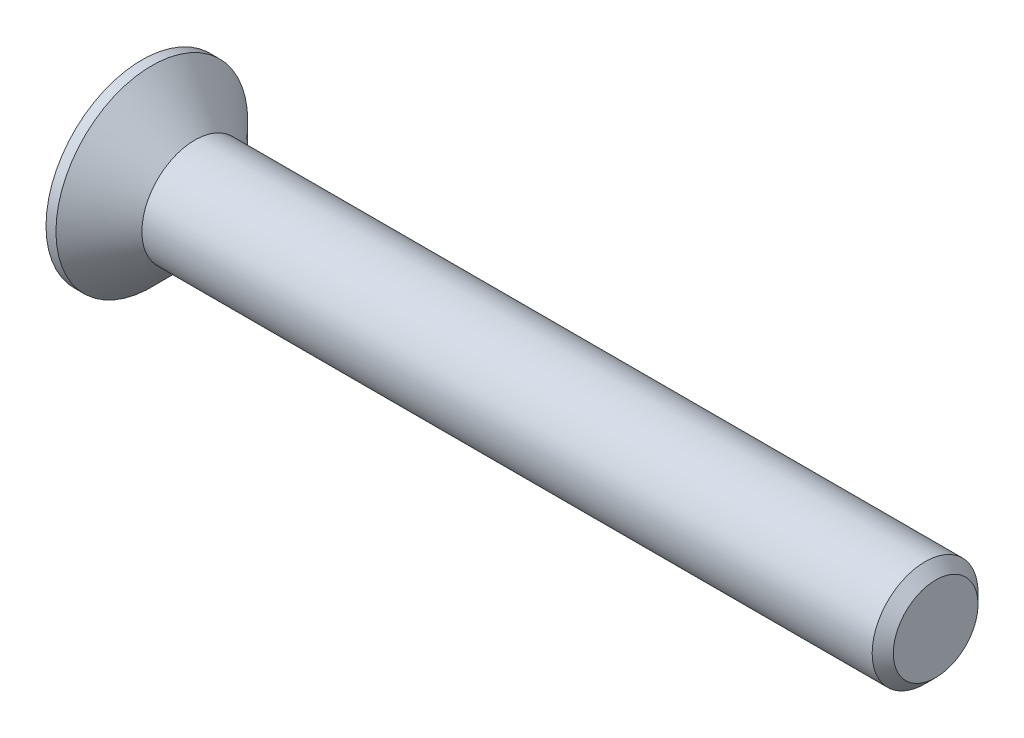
ISO-10303-21;
HEADER;
FILE_DESCRIPTION(('STEP AP214'),'2;1');
FILE_NAME('part.step','',(''),(''),'','','');
FILE_SCHEMA(('AUTOMOTIVE_DESIGN { 1 0 10303 214 1 1 1 1 }'));
ENDSEC;
DATA;
#1=APPLICATION_CONTEXT('core data for automotive mechanical design processes');
#2=APPLICATION_PROTOCOL_DEFINITION('international standard','automotive_design',2000,#1);
#3=PRODUCT_CONTEXT('',#1,'mechanical');
#4=PRODUCT('Part','Part','',(#3));
#5=PRODUCT_RELATED_PRODUCT_CATEGORY('part','',(#4));
#6=PRODUCT_DEFINITION_FORMATION('','',#4);
#7=PRODUCT_DEFINITION_CONTEXT('part definition',#1,'design');
#8=PRODUCT_DEFINITION('design','',#6,#7);
#9=PRODUCT_DEFINITION_SHAPE('','',#8);
#10=(LENGTH_UNIT() NAMED_UNIT(*) SI_UNIT(.MILLI.,.METRE.));
#11=(NAMED_UNIT(*) PLANE_ANGLE_UNIT() SI_UNIT($,.RADIAN.));
#12=(NAMED_UNIT(*) SI_UNIT($,.STERADIAN.) SOLID_ANGLE_UNIT());
#13=UNCERTAINTY_MEASURE_WITH_UNIT(LENGTH_MEASURE(1.E-05),#10,'distance_accuracy_value','');
#14=(GEOMETRIC_REPRESENTATION_CONTEXT(3) GLOBAL_UNCERTAINTY_ASSIGNED_CONTEXT((#13)) GLOBAL_UNIT_ASSIGNED_CONTEXT((#10,
#11,#12)) REPRESENTATION_CONTEXT('',''));
#15=CARTESIAN_POINT('',(0.,0.,0.));
#16=DIRECTION('',(0.,0.,1.));
#17=DIRECTION('',(1.,0.,0.));
#18=AXIS2_PLACEMENT_3D('',#15,#16,#17);
#19=CARTESIAN_POINT('',(0.,0.,0.));
#20=DIRECTION('',(-1.,0.,0.));
#21=DIRECTION('',(0.,0.,1.));
#22=AXIS2_PLACEMENT_3D('',#19,#20,#21);
#23=CONICAL_SURFACE('',#22,4.,0.78539816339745);
#24=CARTESIAN_POINT('',(-3.24999999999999,0.,0.));
#25=DIRECTION('',(-1.,0.,0.));
#26=DIRECTION('',(0.,0.,1.));
#27=AXIS2_PLACEMENT_3D('',#24,#25,#26);
#28=CIRCLE('',#27,7.25);
#29=CARTESIAN_POINT('',(-3.24999999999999,0.,7.25));
#30=VERTEX_POINT('',#29);
#31=EDGE_CURVE('E189',#30,#30,#28,.T.);
#32=ORIENTED_EDGE('',*,*,#31,.F.);
#33=EDGE_LOOP('',(#32));
#34=FACE_BOUND('',#33,.T.);
#35=CARTESIAN_POINT('',(0.,0.,0.));
#36=DIRECTION('',(-1.,0.,0.));
#37=DIRECTION('',(0.,0.,1.));
#38=AXIS2_PLACEMENT_3D('',#35,#36,#37);
#39=CIRCLE('',#38,4.);
#40=CARTESIAN_POINT('',(0.,0.,4.));
#41=VERTEX_POINT('',#40);
#42=EDGE_CURVE('E212',#41,#41,#39,.T.);
#43=ORIENTED_EDGE('',*,*,#42,.T.);
#44=EDGE_LOOP('',(#43));
#45=FACE_BOUND('',#44,.T.);
#46=ADVANCED_FACE('F33',(#34,#45),#23,.T.);
#47=CARTESIAN_POINT('',(-4.,0.,0.));
#48=DIRECTION('',(-1.,0.,0.));
#49=DIRECTION('',(0.,0.,1.));
#50=AXIS2_PLACEMENT_3D('',#47,#48,#49);
#51=CYLINDRICAL_SURFACE('',#50,4.);
#52=CARTESIAN_POINT('',(55.2,0.,0.));
#53=DIRECTION('',(-1.,0.,0.));
#54=DIRECTION('',(0.,0.,1.));
#55=AXIS2_PLACEMENT_3D('',#52,#53,#54);
#56=CIRCLE('',#55,4.);
#57=CARTESIAN_POINT('',(55.2,0.,4.));
#58=VERTEX_POINT('',#57);
#59=EDGE_CURVE('E41',#58,#58,#56,.T.);
#60=ORIENTED_EDGE('',*,*,#59,.T.);
#61=EDGE_LOOP('',(#60));
#62=FACE_BOUND('',#61,.T.);
#63=ORIENTED_EDGE('',*,*,#42,.F.);
#64=EDGE_LOOP('',(#63));
#65=FACE_BOUND('',#64,.T.);
#66=ADVANCED_FACE('F217',(#62,#65),#51,.T.);
#67=CARTESIAN_POINT('',(56.,0.,0.));
#68=DIRECTION('',(-1.,0.,0.));
#69=DIRECTION('',(0.,0.,1.));
#70=AXIS2_PLACEMENT_3D('',#67,#68,#69);
#71=PLANE('',#70);
#72=CARTESIAN_POINT('',(56.,0.,0.));
#73=DIRECTION('',(-1.,0.,0.));
#74=DIRECTION('',(0.,0.,1.));
#75=AXIS2_PLACEMENT_3D('',#72,#73,#74);
#76=CIRCLE('',#75,3.20000000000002);
#77=CARTESIAN_POINT('',(56.,0.,3.20000000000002));
#78=VERTEX_POINT('',#77);
#79=EDGE_CURVE('E11',#78,#78,#76,.F.);
#80=ORIENTED_EDGE('',*,*,#79,.T.);
#81=EDGE_LOOP('',(#80));
#82=FACE_BOUND('',#81,.T.);
#83=ADVANCED_FACE('F239',(#82),#71,.F.);
#84=CARTESIAN_POINT('',(-4.,7.25,0.));
#85=DIRECTION('',(1.,0.,0.));
#86=DIRECTION('',(0.,0.,-1.));
#87=AXIS2_PLACEMENT_3D('',#84,#85,#86);
#88=PLANE('',#87);
#89=DIRECTION('',(0.,0.,-1.));
#90=VECTOR('',#89,1.);
#91=CARTESIAN_POINT('',(-4.,1.09,-4.35));
#92=LINE('',#91,#90);
#93=CARTESIAN_POINT('',(-4.,1.09,-1.09));
#94=VERTEX_POINT('',#93);
#95=CARTESIAN_POINT('',(-4.,1.09,-4.35));
#96=VERTEX_POINT('',#95);
#97=EDGE_CURVE('E158',#94,#96,#92,.T.);
#98=ORIENTED_EDGE('',*,*,#97,.F.);
#99=DIRECTION('',(0.,-1.,0.));
#100=VECTOR('',#99,1.);
#101=CARTESIAN_POINT('',(-4.,1.09,-1.09));
#102=LINE('',#101,#100);
#103=CARTESIAN_POINT('',(-4.,4.35,-1.09));
#104=VERTEX_POINT('',#103);
#105=EDGE_CURVE('E48',#104,#94,#102,.T.);
#106=ORIENTED_EDGE('',*,*,#105,.F.);
#107=DIRECTION('',(0.,0.,-1.));
#108=VECTOR('',#107,1.);
#109=CARTESIAN_POINT('',(-4.,4.35,-1.09));
#110=LINE('',#109,#108);
#111=CARTESIAN_POINT('',(-4.,4.35,1.09));
#112=VERTEX_POINT('',#111);
#113=EDGE_CURVE('E185',#112,#104,#110,.T.);
#114=ORIENTED_EDGE('',*,*,#113,.F.);
#115=DIRECTION('',(0.,1.,0.));
#116=VECTOR('',#115,1.);
#117=CARTESIAN_POINT('',(-4.,4.35,1.09));
#118=LINE('',#117,#116);
#119=CARTESIAN_POINT('',(-4.,1.09,1.09));
#120=VERTEX_POINT('',#119);
#121=EDGE_CURVE('E183',#120,#112,#118,.T.);
#122=ORIENTED_EDGE('',*,*,#121,.F.);
#123=DIRECTION('',(0.,0.,-1.));
#124=VECTOR('',#123,1.);
#125=CARTESIAN_POINT('',(-4.,1.09,1.09));
#126=LINE('',#125,#124);
#127=CARTESIAN_POINT('',(-4.,1.09,4.35));
#128=VERTEX_POINT('',#127);
#129=EDGE_CURVE('E132',#128,#120,#126,.T.);
#130=ORIENTED_EDGE('',*,*,#129,.F.);
#131=DIRECTION('',(0.,1.,0.));
#132=VECTOR('',#131,1.);
#133=CARTESIAN_POINT('',(-4.,1.09,4.35));
#134=LINE('',#133,#132);
#135=CARTESIAN_POINT('',(-4.,-1.09,4.35));
#136=VERTEX_POINT('',#135);
#137=EDGE_CURVE('E179',#136,#128,#134,.T.);
#138=ORIENTED_EDGE('',*,*,#137,.F.);
#139=DIRECTION('',(0.,0.,1.));
#140=VECTOR('',#139,1.);
#141=CARTESIAN_POINT('',(-4.,-1.09,4.35));
#142=LINE('',#141,#140);
#143=CARTESIAN_POINT('',(-4.,-1.09,1.09));
#144=VERTEX_POINT('',#143);
#145=EDGE_CURVE('E176',#144,#136,#142,.T.);
#146=ORIENTED_EDGE('',*,*,#145,.F.);
#147=DIRECTION('',(0.,1.,0.));
#148=VECTOR('',#147,1.);
#149=CARTESIAN_POINT('',(-4.,-1.09,1.09));
#150=LINE('',#149,#148);
#151=CARTESIAN_POINT('',(-4.,-4.35,1.09));
#152=VERTEX_POINT('',#151);
#153=EDGE_CURVE('E173',#152,#144,#150,.T.);
#154=ORIENTED_EDGE('',*,*,#153,.F.);
#155=DIRECTION('',(0.,0.,1.));
#156=VECTOR('',#155,1.);
#157=CARTESIAN_POINT('',(-4.,-4.35,1.09));
#158=LINE('',#157,#156);
#159=CARTESIAN_POINT('',(-4.,-4.35,-1.09));
#160=VERTEX_POINT('',#159);
#161=EDGE_CURVE('E170',#160,#152,#158,.T.);
#162=ORIENTED_EDGE('',*,*,#161,.F.);
#163=DIRECTION('',(0.,-1.,0.));
#164=VECTOR('',#163,1.);
#165=CARTESIAN_POINT('',(-4.,-4.35,-1.09));
#166=LINE('',#165,#164);
#167=CARTESIAN_POINT('',(-4.,-1.09,-1.09));
#168=VERTEX_POINT('',#167);
#169=EDGE_CURVE('E167',#168,#160,#166,.T.);
#170=ORIENTED_EDGE('',*,*,#169,.F.);
#171=DIRECTION('',(0.,0.,1.));
#172=VECTOR('',#171,1.);
#173=CARTESIAN_POINT('',(-4.,-1.09,-1.09));
#174=LINE('',#173,#172);
#175=CARTESIAN_POINT('',(-4.,-1.09,-4.35));
#176=VERTEX_POINT('',#175);
#177=EDGE_CURVE('E164',#176,#168,#174,.T.);
#178=ORIENTED_EDGE('',*,*,#177,.F.);
#179=DIRECTION('',(0.,-1.,0.));
#180=VECTOR('',#179,1.);
#181=CARTESIAN_POINT('',(-4.,-1.09,-4.35));
#182=LINE('',#181,#180);
#183=EDGE_CURVE('E161',#96,#176,#182,.T.);
#184=ORIENTED_EDGE('',*,*,#183,.F.);
#185=EDGE_LOOP('',(#98,#106,#114,#122,#130,#138,#146,#154,#162,#170,#178,#184));
#186=FACE_BOUND('',#185,.T.);
#187=CARTESIAN_POINT('',(-4.,0.,0.));
#188=DIRECTION('',(-1.,0.,0.));
#189=DIRECTION('',(0.,0.,1.));
#190=AXIS2_PLACEMENT_3D('',#187,#188,#189);
#191=CIRCLE('',#190,7.25);
#192=CARTESIAN_POINT('',(-4.,0.,7.25));
#193=VERTEX_POINT('',#192);
#194=EDGE_CURVE('E209',#193,#193,#191,.T.);
#195=ORIENTED_EDGE('',*,*,#194,.T.);
#196=EDGE_LOOP('',(#195));
#197=FACE_BOUND('',#196,.T.);
#198=ADVANCED_FACE('F230',(#186,#197),#88,.F.);
#199=CARTESIAN_POINT('',(-4.,0.,0.));
#200=DIRECTION('',(-1.,0.,0.));
#201=DIRECTION('',(0.,0.,1.));
#202=AXIS2_PLACEMENT_3D('',#199,#200,#201);
#203=CYLINDRICAL_SURFACE('',#202,7.25);
#204=ORIENTED_EDGE('',*,*,#194,.F.);
#205=EDGE_LOOP('',(#204));
#206=FACE_BOUND('',#205,.T.);
#207=ORIENTED_EDGE('',*,*,#31,.T.);
#208=EDGE_LOOP('',(#207));
#209=FACE_BOUND('',#208,.T.);
#210=ADVANCED_FACE('F222',(#206,#209),#203,.T.);
#211=CARTESIAN_POINT('',(55.2,0.,0.));
#212=DIRECTION('',(-1.,0.,0.));
#213=DIRECTION('',(0.,0.,1.));
#214=AXIS2_PLACEMENT_3D('',#211,#212,#213);
#215=CONICAL_SURFACE('',#214,4.,0.785398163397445);
#216=ORIENTED_EDGE('',*,*,#79,.F.);
#217=EDGE_LOOP('',(#216));
#218=FACE_BOUND('',#217,.T.);
#219=ORIENTED_EDGE('',*,*,#59,.F.);
#220=EDGE_LOOP('',(#219));
#221=FACE_BOUND('',#220,.T.);
#222=ADVANCED_FACE('F35',(#218,#221),#215,.T.);
#223=CARTESIAN_POINT('',(-0.55,1.09,-1.09));
#224=DIRECTION('',(0.,0.,-1.));
#225=DIRECTION('',(-1.,0.,0.));
#226=AXIS2_PLACEMENT_3D('',#223,#224,#225);
#227=PLANE('',#226);
#228=ORIENTED_EDGE('',*,*,#105,.T.);
#229=DIRECTION('',(-1.,0.,0.));
#230=VECTOR('',#229,1.);
#231=CARTESIAN_POINT('',(-0.55,1.09,-1.09));
#232=LINE('',#231,#230);
#233=CARTESIAN_POINT('',(-0.55,1.09,-1.09));
#234=VERTEX_POINT('',#233);
#235=EDGE_CURVE('E96',#234,#94,#232,.T.);
#236=ORIENTED_EDGE('',*,*,#235,.F.);
#237=DIRECTION('',(0.,-1.,0.));
#238=VECTOR('',#237,1.);
#239=CARTESIAN_POINT('',(-0.55,1.09,-1.09));
#240=LINE('',#239,#238);
#241=CARTESIAN_POINT('',(-0.55,4.35,-1.09));
#242=VERTEX_POINT('',#241);
#243=EDGE_CURVE('E187',#242,#234,#240,.T.);
#244=ORIENTED_EDGE('',*,*,#243,.F.);
#245=DIRECTION('',(-1.,0.,0.));
#246=VECTOR('',#245,1.);
#247=CARTESIAN_POINT('',(-0.55,4.35,-1.09));
#248=LINE('',#247,#246);
#249=EDGE_CURVE('E56',#242,#104,#248,.T.);
#250=ORIENTED_EDGE('',*,*,#249,.T.);
#251=EDGE_LOOP('',(#228,#236,#244,#250));
#252=FACE_BOUND('',#251,.T.);
#253=ADVANCED_FACE('F221',(#252),#227,.F.);
#254=CARTESIAN_POINT('',(-0.55,4.35,-1.09));
#255=DIRECTION('',(0.,1.,0.));
#256=DIRECTION('',(-1.,0.,0.));
#257=AXIS2_PLACEMENT_3D('',#254,#255,#256);
#258=PLANE('',#257);
#259=ORIENTED_EDGE('',*,*,#113,.T.);
#260=ORIENTED_EDGE('',*,*,#249,.F.);
#261=DIRECTION('',(0.,0.,-1.));
#262=VECTOR('',#261,1.);
#263=CARTESIAN_POINT('',(-0.55,4.35,-1.09));
#264=LINE('',#263,#262);
#265=CARTESIAN_POINT('',(-0.55,4.35,1.09));
#266=VERTEX_POINT('',#265);
#267=EDGE_CURVE('E144',#266,#242,#264,.T.);
#268=ORIENTED_EDGE('',*,*,#267,.F.);
#269=DIRECTION('',(-1.,0.,0.));
#270=VECTOR('',#269,1.);
#271=CARTESIAN_POINT('',(-0.55,4.35,1.09));
#272=LINE('',#271,#270);
#273=EDGE_CURVE('E136',#266,#112,#272,.T.);
#274=ORIENTED_EDGE('',*,*,#273,.T.);
#275=EDGE_LOOP('',(#259,#260,#268,#274));
#276=FACE_BOUND('',#275,.T.);
#277=ADVANCED_FACE('F228',(#276),#258,.F.);
#278=CARTESIAN_POINT('',(-0.55,4.35,1.09));
#279=DIRECTION('',(0.,0.,1.));
#280=DIRECTION('',(1.,0.,0.));
#281=AXIS2_PLACEMENT_3D('',#278,#279,#280);
#282=PLANE('',#281);
#283=ORIENTED_EDGE('',*,*,#121,.T.);
#284=ORIENTED_EDGE('',*,*,#273,.F.);
#285=DIRECTION('',(0.,1.,0.));
#286=VECTOR('',#285,1.);
#287=CARTESIAN_POINT('',(-0.55,4.35,1.09));
#288=LINE('',#287,#286);
#289=CARTESIAN_POINT('',(-0.55,1.09,1.09));
#290=VERTEX_POINT('',#289);
#291=EDGE_CURVE('E140',#290,#266,#288,.T.);
#292=ORIENTED_EDGE('',*,*,#291,.F.);
#293=DIRECTION('',(-1.,0.,0.));
#294=VECTOR('',#293,1.);
#295=CARTESIAN_POINT('',(-0.55,1.09,1.09));
#296=LINE('',#295,#294);
#297=EDGE_CURVE('E125',#290,#120,#296,.T.);
#298=ORIENTED_EDGE('',*,*,#297,.T.);
#299=EDGE_LOOP('',(#283,#284,#292,#298));
#300=FACE_BOUND('',#299,.T.);
#301=ADVANCED_FACE('F141',(#300),#282,.F.);
#302=CARTESIAN_POINT('',(-0.55,1.09,1.09));
#303=DIRECTION('',(0.,1.,0.));
#304=DIRECTION('',(-1.,0.,0.));
#305=AXIS2_PLACEMENT_3D('',#302,#303,#304);
#306=PLANE('',#305);
#307=ORIENTED_EDGE('',*,*,#129,.T.);
#308=ORIENTED_EDGE('',*,*,#297,.F.);
#309=DIRECTION('',(0.,0.,-1.));
#310=VECTOR('',#309,1.);
#311=CARTESIAN_POINT('',(-0.55,1.09,1.09));
#312=LINE('',#311,#310);
#313=CARTESIAN_POINT('',(-0.55,1.09,4.35));
#314=VERTEX_POINT('',#313);
#315=EDGE_CURVE('E129',#314,#290,#312,.T.);
#316=ORIENTED_EDGE('',*,*,#315,.F.);
#317=DIRECTION('',(-1.,0.,0.));
#318=VECTOR('',#317,1.);
#319=CARTESIAN_POINT('',(-0.55,1.09,4.35));
#320=LINE('',#319,#318);
#321=EDGE_CURVE('E137',#314,#128,#320,.T.);
#322=ORIENTED_EDGE('',*,*,#321,.T.);
#323=EDGE_LOOP('',(#307,#308,#316,#322));
#324=FACE_BOUND('',#323,.T.);
#325=ADVANCED_FACE('F127',(#324),#306,.F.);
#326=CARTESIAN_POINT('',(-0.55,1.09,4.35));
#327=DIRECTION('',(0.,0.,1.));
#328=DIRECTION('',(1.,0.,0.));
#329=AXIS2_PLACEMENT_3D('',#326,#327,#328);
#330=PLANE('',#329);
#331=ORIENTED_EDGE('',*,*,#137,.T.);
#332=ORIENTED_EDGE('',*,*,#321,.F.);
#333=DIRECTION('',(0.,1.,0.));
#334=VECTOR('',#333,1.);
#335=CARTESIAN_POINT('',(-0.55,1.09,4.35));
#336=LINE('',#335,#334);
#337=CARTESIAN_POINT('',(-0.55,-1.09,4.35));
#338=VERTEX_POINT('',#337);
#339=EDGE_CURVE('E150',#338,#314,#336,.T.);
#340=ORIENTED_EDGE('',*,*,#339,.F.);
#341=DIRECTION('',(-1.,0.,0.));
#342=VECTOR('',#341,1.);
#343=CARTESIAN_POINT('',(-0.55,-1.09,4.35));
#344=LINE('',#343,#342);
#345=EDGE_CURVE('E192',#338,#136,#344,.T.);
#346=ORIENTED_EDGE('',*,*,#345,.T.);
#347=EDGE_LOOP('',(#331,#332,#340,#346));
#348=FACE_BOUND('',#347,.T.);
#349=ADVANCED_FACE('F277',(#348),#330,.F.);
#350=CARTESIAN_POINT('',(-0.55,-1.09,4.35));
#351=DIRECTION('',(0.,-1.,0.));
#352=DIRECTION('',(1.,0.,0.));
#353=AXIS2_PLACEMENT_3D('',#350,#351,#352);
#354=PLANE('',#353);
#355=ORIENTED_EDGE('',*,*,#145,.T.);
#356=ORIENTED_EDGE('',*,*,#345,.F.);
#357=DIRECTION('',(0.,0.,1.));
#358=VECTOR('',#357,1.);
#359=CARTESIAN_POINT('',(-0.55,-1.09,4.35));
#360=LINE('',#359,#358);
#361=CARTESIAN_POINT('',(-0.55,-1.09,1.09));
#362=VERTEX_POINT('',#361);
#363=EDGE_CURVE('E152',#362,#338,#360,.T.);
#364=ORIENTED_EDGE('',*,*,#363,.F.);
#365=DIRECTION('',(-1.,0.,0.));
#366=VECTOR('',#365,1.);
#367=CARTESIAN_POINT('',(-0.55,-1.09,1.09));
#368=LINE('',#367,#366);
#369=EDGE_CURVE('E194',#362,#144,#368,.T.);
#370=ORIENTED_EDGE('',*,*,#369,.T.);
#371=EDGE_LOOP('',(#355,#356,#364,#370));
#372=FACE_BOUND('',#371,.T.);
#373=ADVANCED_FACE('F273',(#372),#354,.F.);
#374=CARTESIAN_POINT('',(-0.55,-1.09,1.09));
#375=DIRECTION('',(0.,0.,1.));
#376=DIRECTION('',(1.,0.,0.));
#377=AXIS2_PLACEMENT_3D('',#374,#375,#376);
#378=PLANE('',#377);
#379=ORIENTED_EDGE('',*,*,#153,.T.);
#380=ORIENTED_EDGE('',*,*,#369,.F.);
#381=DIRECTION('',(0.,1.,0.));
#382=VECTOR('',#381,1.);
#383=CARTESIAN_POINT('',(-0.55,-1.09,1.09));
#384=LINE('',#383,#382);
#385=CARTESIAN_POINT('',(-0.55,-4.35,1.09));
#386=VERTEX_POINT('',#385);
#387=EDGE_CURVE('E422',#386,#362,#384,.T.);
#388=ORIENTED_EDGE('',*,*,#387,.F.);
#389=DIRECTION('',(-1.,0.,0.));
#390=VECTOR('',#389,1.);
#391=CARTESIAN_POINT('',(-0.55,-4.35,1.09));
#392=LINE('',#391,#390);
#393=EDGE_CURVE('E196',#386,#152,#392,.T.);
#394=ORIENTED_EDGE('',*,*,#393,.T.);
#395=EDGE_LOOP('',(#379,#380,#388,#394));
#396=FACE_BOUND('',#395,.T.);
#397=ADVANCED_FACE('F269',(#396),#378,.F.);
#398=CARTESIAN_POINT('',(-0.55,-4.35,1.09));
#399=DIRECTION('',(0.,-1.,0.));
#400=DIRECTION('',(1.,0.,0.));
#401=AXIS2_PLACEMENT_3D('',#398,#399,#400);
#402=PLANE('',#401);
#403=ORIENTED_EDGE('',*,*,#161,.T.);
#404=ORIENTED_EDGE('',*,*,#393,.F.);
#405=DIRECTION('',(0.,0.,1.));
#406=VECTOR('',#405,1.);
#407=CARTESIAN_POINT('',(-0.55,-4.35,1.09));
#408=LINE('',#407,#406);
#409=CARTESIAN_POINT('',(-0.55,-4.35,-1.09));
#410=VERTEX_POINT('',#409);
#411=EDGE_CURVE('E419',#410,#386,#408,.T.);
#412=ORIENTED_EDGE('',*,*,#411,.F.);
#413=DIRECTION('',(-1.,0.,0.));
#414=VECTOR('',#413,1.);
#415=CARTESIAN_POINT('',(-0.55,-4.35,-1.09));
#416=LINE('',#415,#414);
#417=EDGE_CURVE('E198',#410,#160,#416,.T.);
#418=ORIENTED_EDGE('',*,*,#417,.T.);
#419=EDGE_LOOP('',(#403,#404,#412,#418));
#420=FACE_BOUND('',#419,.T.);
#421=ADVANCED_FACE('F265',(#420),#402,.F.);
#422=CARTESIAN_POINT('',(-0.55,-4.35,-1.09));
#423=DIRECTION('',(0.,0.,-1.));
#424=DIRECTION('',(-1.,0.,0.));
#425=AXIS2_PLACEMENT_3D('',#422,#423,#424);
#426=PLANE('',#425);
#427=ORIENTED_EDGE('',*,*,#169,.T.);
#428=ORIENTED_EDGE('',*,*,#417,.F.);
#429=DIRECTION('',(0.,-1.,0.));
#430=VECTOR('',#429,1.);
#431=CARTESIAN_POINT('',(-0.55,-4.35,-1.09));
#432=LINE('',#431,#430);
#433=CARTESIAN_POINT('',(-0.55,-1.09,-1.09));
#434=VERTEX_POINT('',#433);
#435=EDGE_CURVE('E416',#434,#410,#432,.T.);
#436=ORIENTED_EDGE('',*,*,#435,.F.);
#437=DIRECTION('',(-1.,0.,0.));
#438=VECTOR('',#437,1.);
#439=CARTESIAN_POINT('',(-0.55,-1.09,-1.09));
#440=LINE('',#439,#438);
#441=EDGE_CURVE('E200',#434,#168,#440,.T.);
#442=ORIENTED_EDGE('',*,*,#441,.T.);
#443=EDGE_LOOP('',(#427,#428,#436,#442));
#444=FACE_BOUND('',#443,.T.);
#445=ADVANCED_FACE('F261',(#444),#426,.F.);
#446=CARTESIAN_POINT('',(-0.55,-1.09,-1.09));
#447=DIRECTION('',(0.,-1.,0.));
#448=DIRECTION('',(1.,0.,0.));
#449=AXIS2_PLACEMENT_3D('',#446,#447,#448);
#450=PLANE('',#449);
#451=ORIENTED_EDGE('',*,*,#177,.T.);
#452=ORIENTED_EDGE('',*,*,#441,.F.);
#453=DIRECTION('',(0.,0.,1.));
#454=VECTOR('',#453,1.);
#455=CARTESIAN_POINT('',(-0.55,-1.09,-1.09));
#456=LINE('',#455,#454);
#457=CARTESIAN_POINT('',(-0.55,-1.09,-4.35));
#458=VERTEX_POINT('',#457);
#459=EDGE_CURVE('E413',#458,#434,#456,.T.);
#460=ORIENTED_EDGE('',*,*,#459,.F.);
#461=DIRECTION('',(-1.,0.,0.));
#462=VECTOR('',#461,1.);
#463=CARTESIAN_POINT('',(-0.55,-1.09,-4.35));
#464=LINE('',#463,#462);
#465=EDGE_CURVE('E202',#458,#176,#464,.T.);
#466=ORIENTED_EDGE('',*,*,#465,.T.);
#467=EDGE_LOOP('',(#451,#452,#460,#466));
#468=FACE_BOUND('',#467,.T.);
#469=ADVANCED_FACE('F257',(#468),#450,.F.);
#470=CARTESIAN_POINT('',(-0.55,-1.09,-4.35));
#471=DIRECTION('',(0.,0.,-1.));
#472=DIRECTION('',(-1.,0.,0.));
#473=AXIS2_PLACEMENT_3D('',#470,#471,#472);
#474=PLANE('',#473);
#475=ORIENTED_EDGE('',*,*,#183,.T.);
#476=ORIENTED_EDGE('',*,*,#465,.F.);
#477=DIRECTION('',(0.,-1.,0.));
#478=VECTOR('',#477,1.);
#479=CARTESIAN_POINT('',(-0.55,-1.09,-4.35));
#480=LINE('',#479,#478);
#481=CARTESIAN_POINT('',(-0.55,1.09,-4.35));
#482=VERTEX_POINT('',#481);
#483=EDGE_CURVE('E408',#482,#458,#480,.T.);
#484=ORIENTED_EDGE('',*,*,#483,.F.);
#485=DIRECTION('',(-1.,0.,0.));
#486=VECTOR('',#485,1.);
#487=CARTESIAN_POINT('',(-0.55,1.09,-4.35));
#488=LINE('',#487,#486);
#489=EDGE_CURVE('E204',#482,#96,#488,.T.);
#490=ORIENTED_EDGE('',*,*,#489,.T.);
#491=EDGE_LOOP('',(#475,#476,#484,#490));
#492=FACE_BOUND('',#491,.T.);
#493=ADVANCED_FACE('F253',(#492),#474,.F.);
#494=CARTESIAN_POINT('',(-0.55,1.09,-4.35));
#495=DIRECTION('',(0.,1.,0.));
#496=DIRECTION('',(-1.,0.,0.));
#497=AXIS2_PLACEMENT_3D('',#494,#495,#496);
#498=PLANE('',#497);
#499=ORIENTED_EDGE('',*,*,#97,.T.);
#500=ORIENTED_EDGE('',*,*,#489,.F.);
#501=DIRECTION('',(0.,0.,-1.));
#502=VECTOR('',#501,1.);
#503=CARTESIAN_POINT('',(-0.55,1.09,-4.35));
#504=LINE('',#503,#502);
#505=EDGE_CURVE('E406',#234,#482,#504,.T.);
#506=ORIENTED_EDGE('',*,*,#505,.F.);
#507=ORIENTED_EDGE('',*,*,#235,.T.);
#508=EDGE_LOOP('',(#499,#500,#506,#507));
#509=FACE_BOUND('',#508,.T.);
#510=ADVANCED_FACE('F250',(#509),#498,.F.);
#511=CARTESIAN_POINT('',(-0.55,0.,0.));
#512=DIRECTION('',(1.,0.,0.));
#513=DIRECTION('',(0.,0.,-1.));
#514=AXIS2_PLACEMENT_3D('',#511,#512,#513);
#515=PLANE('',#514);
#516=ORIENTED_EDGE('',*,*,#243,.T.);
#517=ORIENTED_EDGE('',*,*,#505,.T.);
#518=ORIENTED_EDGE('',*,*,#483,.T.);
#519=ORIENTED_EDGE('',*,*,#459,.T.);
#520=ORIENTED_EDGE('',*,*,#435,.T.);
#521=ORIENTED_EDGE('',*,*,#411,.T.);
#522=ORIENTED_EDGE('',*,*,#387,.T.);
#523=ORIENTED_EDGE('',*,*,#363,.T.);
#524=ORIENTED_EDGE('',*,*,#339,.T.);
#525=ORIENTED_EDGE('',*,*,#315,.T.);
#526=ORIENTED_EDGE('',*,*,#291,.T.);
#527=ORIENTED_EDGE('',*,*,#267,.T.);
#528=EDGE_LOOP('',(#516,#517,#518,#519,#520,#521,#522,#523,#524,#525,#526,#527));
#529=FACE_BOUND('',#528,.T.);
#530=ADVANCED_FACE('F147',(#529),#515,.F.);
#531=CLOSED_SHELL('',(#46,#66,#83,#198,#210,#222,#253,#277,#301,#325,#349,#373,#397,#421,#445,
#469,#493,#510,#530));
#532=MANIFOLD_SOLID_BREP('B2',#531);
#533=ADVANCED_BREP_SHAPE_REPRESENTATION('',(#18,#532),#14);
#534=SHAPE_DEFINITION_REPRESENTATION(#9,#533);
ENDSEC;
END-ISO-10303-21;
